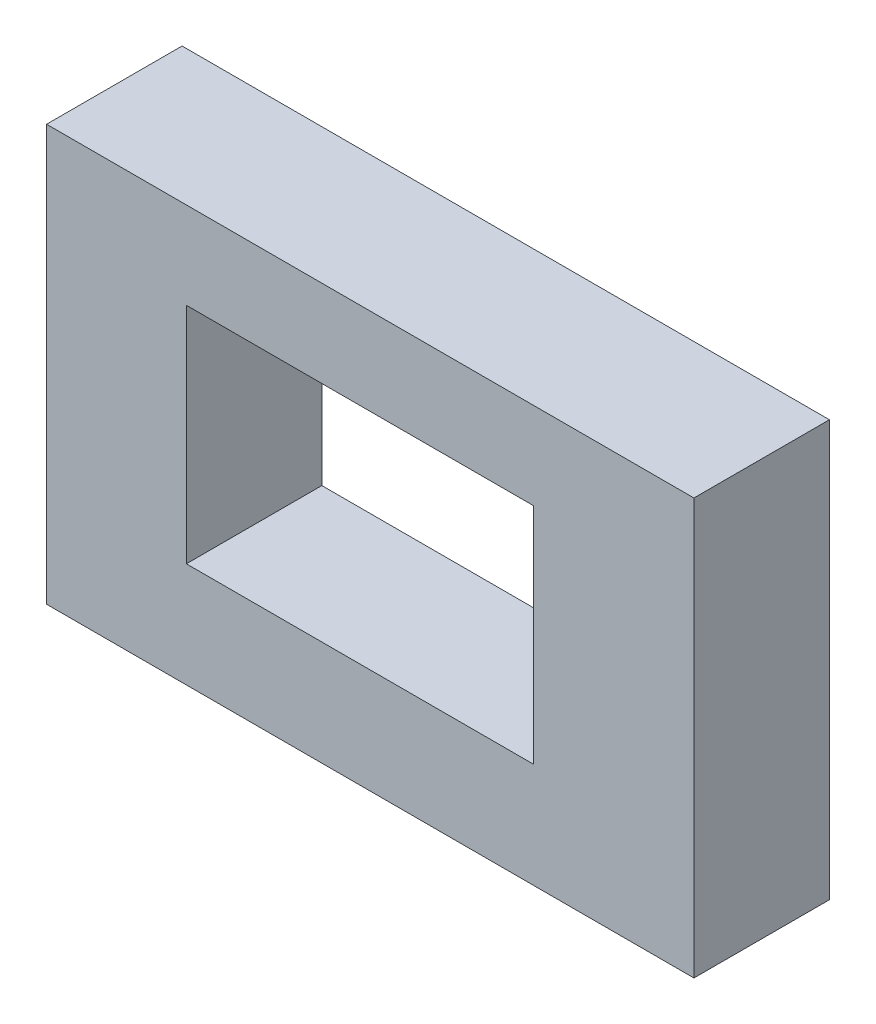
ISO-10303-21;
HEADER;
FILE_DESCRIPTION(('STEP AP214'),'2;1');
FILE_NAME('part.step','',(''),(''),'','','');
FILE_SCHEMA(('AUTOMOTIVE_DESIGN { 1 0 10303 214 1 1 1 1 }'));
ENDSEC;
DATA;
#1=APPLICATION_CONTEXT('core data for automotive mechanical design processes');
#2=APPLICATION_PROTOCOL_DEFINITION('international standard','automotive_design',2000,#1);
#3=PRODUCT_CONTEXT('',#1,'mechanical');
#4=PRODUCT('Part','Part','',(#3));
#5=PRODUCT_RELATED_PRODUCT_CATEGORY('part','',(#4));
#6=PRODUCT_DEFINITION_FORMATION('','',#4);
#7=PRODUCT_DEFINITION_CONTEXT('part definition',#1,'design');
#8=PRODUCT_DEFINITION('design','',#6,#7);
#9=PRODUCT_DEFINITION_SHAPE('','',#8);
#10=(LENGTH_UNIT() NAMED_UNIT(*) SI_UNIT(.MILLI.,.METRE.));
#11=(NAMED_UNIT(*) PLANE_ANGLE_UNIT() SI_UNIT($,.RADIAN.));
#12=(NAMED_UNIT(*) SI_UNIT($,.STERADIAN.) SOLID_ANGLE_UNIT());
#13=UNCERTAINTY_MEASURE_WITH_UNIT(LENGTH_MEASURE(1.E-05),#10,'distance_accuracy_value','');
#14=(GEOMETRIC_REPRESENTATION_CONTEXT(3) GLOBAL_UNCERTAINTY_ASSIGNED_CONTEXT((#13)) GLOBAL_UNIT_ASSIGNED_CONTEXT((#10,
#11,#12)) REPRESENTATION_CONTEXT('',''));
#15=CARTESIAN_POINT('',(0.,0.,0.));
#16=DIRECTION('',(0.,0.,1.));
#17=DIRECTION('',(1.,0.,0.));
#18=AXIS2_PLACEMENT_3D('',#15,#16,#17);
#19=CARTESIAN_POINT('',(0.,0.,10.));
#20=DIRECTION('',(0.,0.,-1.));
#21=DIRECTION('',(-1.,0.,0.));
#22=AXIS2_PLACEMENT_3D('',#19,#20,#21);
#23=PLANE('',#22);
#24=DIRECTION('',(0.,1.,0.));
#25=VECTOR('',#24,1.);
#26=CARTESIAN_POINT('',(23.8891463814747,-16.2183195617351,10.));
#27=LINE('',#26,#25);
#28=CARTESIAN_POINT('',(23.8891463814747,-16.2183195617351,10.));
#29=VERTEX_POINT('',#28);
#30=CARTESIAN_POINT('',(23.8891463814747,14.4649877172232,10.));
#31=VERTEX_POINT('',#30);
#32=EDGE_CURVE('E134',#29,#31,#27,.T.);
#33=ORIENTED_EDGE('',*,*,#32,.T.);
#34=DIRECTION('',(-1.,0.,0.));
#35=VECTOR('',#34,1.);
#36=CARTESIAN_POINT('',(-23.8891463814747,14.4649877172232,10.));
#37=LINE('',#36,#35);
#38=CARTESIAN_POINT('',(-23.8891463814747,14.4649877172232,10.));
#39=VERTEX_POINT('',#38);
#40=EDGE_CURVE('E137',#31,#39,#37,.T.);
#41=ORIENTED_EDGE('',*,*,#40,.T.);
#42=DIRECTION('',(0.,-1.,0.));
#43=VECTOR('',#42,1.);
#44=CARTESIAN_POINT('',(-23.8891463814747,-16.2183195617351,10.));
#45=LINE('',#44,#43);
#46=CARTESIAN_POINT('',(-23.8891463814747,-16.2183195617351,10.));
#47=VERTEX_POINT('',#46);
#48=EDGE_CURVE('E140',#39,#47,#45,.T.);
#49=ORIENTED_EDGE('',*,*,#48,.T.);
#50=DIRECTION('',(1.,0.,0.));
#51=VECTOR('',#50,1.);
#52=CARTESIAN_POINT('',(-23.8891463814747,-16.2183195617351,10.));
#53=LINE('',#52,#51);
#54=EDGE_CURVE('E142',#47,#29,#53,.T.);
#55=ORIENTED_EDGE('',*,*,#54,.T.);
#56=EDGE_LOOP('',(#33,#41,#49,#55));
#57=FACE_BOUND('',#56,.T.);
#58=DIRECTION('',(0.,1.,0.));
#59=VECTOR('',#58,1.);
#60=CARTESIAN_POINT('',(12.064003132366,-8.47367297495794,10.));
#61=LINE('',#60,#59);
#62=CARTESIAN_POINT('',(12.064003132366,-8.47367297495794,10.));
#63=VERTEX_POINT('',#62);
#64=CARTESIAN_POINT('',(12.064003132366,8.05080119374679,10.));
#65=VERTEX_POINT('',#64);
#66=EDGE_CURVE('E98',#63,#65,#61,.T.);
#67=ORIENTED_EDGE('',*,*,#66,.F.);
#68=DIRECTION('',(1.,0.,0.));
#69=VECTOR('',#68,1.);
#70=CARTESIAN_POINT('',(-13.5720035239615,-8.47367297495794,10.));
#71=LINE('',#70,#69);
#72=CARTESIAN_POINT('',(-13.5720035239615,-8.47367297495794,10.));
#73=VERTEX_POINT('',#72);
#74=EDGE_CURVE('E120',#73,#63,#71,.T.);
#75=ORIENTED_EDGE('',*,*,#74,.F.);
#76=DIRECTION('',(0.,-1.,0.));
#77=VECTOR('',#76,1.);
#78=CARTESIAN_POINT('',(-13.5720035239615,-8.47367297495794,10.));
#79=LINE('',#78,#77);
#80=CARTESIAN_POINT('',(-13.5720035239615,8.05080119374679,10.));
#81=VERTEX_POINT('',#80);
#82=EDGE_CURVE('E118',#81,#73,#79,.T.);
#83=ORIENTED_EDGE('',*,*,#82,.F.);
#84=DIRECTION('',(-1.,0.,0.));
#85=VECTOR('',#84,1.);
#86=CARTESIAN_POINT('',(-13.5720035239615,8.05080119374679,10.));
#87=LINE('',#86,#85);
#88=EDGE_CURVE('E106',#65,#81,#87,.T.);
#89=ORIENTED_EDGE('',*,*,#88,.F.);
#90=EDGE_LOOP('',(#67,#75,#83,#89));
#91=FACE_BOUND('',#90,.T.);
#92=ADVANCED_FACE('F33',(#57,#91),#23,.F.);
#93=CARTESIAN_POINT('',(0.,0.,0.));
#94=DIRECTION('',(0.,0.,-1.));
#95=DIRECTION('',(-1.,0.,0.));
#96=AXIS2_PLACEMENT_3D('',#93,#94,#95);
#97=PLANE('',#96);
#98=DIRECTION('',(0.,1.,0.));
#99=VECTOR('',#98,1.);
#100=CARTESIAN_POINT('',(23.8891463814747,-16.2183195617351,0.));
#101=LINE('',#100,#99);
#102=CARTESIAN_POINT('',(23.8891463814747,-16.2183195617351,0.));
#103=VERTEX_POINT('',#102);
#104=CARTESIAN_POINT('',(23.8891463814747,14.4649877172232,0.));
#105=VERTEX_POINT('',#104);
#106=EDGE_CURVE('E114',#103,#105,#101,.T.);
#107=ORIENTED_EDGE('',*,*,#106,.F.);
#108=DIRECTION('',(1.,0.,0.));
#109=VECTOR('',#108,1.);
#110=CARTESIAN_POINT('',(-23.8891463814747,-16.2183195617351,0.));
#111=LINE('',#110,#109);
#112=CARTESIAN_POINT('',(-23.8891463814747,-16.2183195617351,0.));
#113=VERTEX_POINT('',#112);
#114=EDGE_CURVE('E138',#113,#103,#111,.T.);
#115=ORIENTED_EDGE('',*,*,#114,.F.);
#116=DIRECTION('',(0.,-1.,0.));
#117=VECTOR('',#116,1.);
#118=CARTESIAN_POINT('',(-23.8891463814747,-16.2183195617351,0.));
#119=LINE('',#118,#117);
#120=CARTESIAN_POINT('',(-23.8891463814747,14.4649877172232,0.));
#121=VERTEX_POINT('',#120);
#122=EDGE_CURVE('E149',#121,#113,#119,.T.);
#123=ORIENTED_EDGE('',*,*,#122,.F.);
#124=DIRECTION('',(-1.,0.,0.));
#125=VECTOR('',#124,1.);
#126=CARTESIAN_POINT('',(-23.8891463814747,14.4649877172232,0.));
#127=LINE('',#126,#125);
#128=EDGE_CURVE('E147',#105,#121,#127,.T.);
#129=ORIENTED_EDGE('',*,*,#128,.F.);
#130=EDGE_LOOP('',(#107,#115,#123,#129));
#131=FACE_BOUND('',#130,.T.);
#132=DIRECTION('',(1.,0.,0.));
#133=VECTOR('',#132,1.);
#134=CARTESIAN_POINT('',(-13.5720035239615,-8.47367297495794,0.));
#135=LINE('',#134,#133);
#136=CARTESIAN_POINT('',(-13.5720035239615,-8.47367297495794,0.));
#137=VERTEX_POINT('',#136);
#138=CARTESIAN_POINT('',(12.064003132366,-8.47367297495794,0.));
#139=VERTEX_POINT('',#138);
#140=EDGE_CURVE('E107',#137,#139,#135,.T.);
#141=ORIENTED_EDGE('',*,*,#140,.T.);
#142=DIRECTION('',(0.,1.,0.));
#143=VECTOR('',#142,1.);
#144=CARTESIAN_POINT('',(12.064003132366,-8.47367297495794,0.));
#145=LINE('',#144,#143);
#146=CARTESIAN_POINT('',(12.064003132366,8.05080119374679,0.));
#147=VERTEX_POINT('',#146);
#148=EDGE_CURVE('E56',#139,#147,#145,.T.);
#149=ORIENTED_EDGE('',*,*,#148,.T.);
#150=DIRECTION('',(-1.,0.,0.));
#151=VECTOR('',#150,1.);
#152=CARTESIAN_POINT('',(-13.5720035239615,8.05080119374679,0.));
#153=LINE('',#152,#151);
#154=CARTESIAN_POINT('',(-13.5720035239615,8.05080119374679,0.));
#155=VERTEX_POINT('',#154);
#156=EDGE_CURVE('E113',#147,#155,#153,.T.);
#157=ORIENTED_EDGE('',*,*,#156,.T.);
#158=DIRECTION('',(0.,-1.,0.));
#159=VECTOR('',#158,1.);
#160=CARTESIAN_POINT('',(-13.5720035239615,-8.47367297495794,0.));
#161=LINE('',#160,#159);
#162=EDGE_CURVE('E126',#155,#137,#161,.T.);
#163=ORIENTED_EDGE('',*,*,#162,.T.);
#164=EDGE_LOOP('',(#141,#149,#157,#163));
#165=FACE_BOUND('',#164,.T.);
#166=ADVANCED_FACE('F167',(#131,#165),#97,.T.);
#167=CARTESIAN_POINT('',(23.8891463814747,-16.2183195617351,10.));
#168=DIRECTION('',(-1.,0.,0.));
#169=DIRECTION('',(0.,0.,1.));
#170=AXIS2_PLACEMENT_3D('',#167,#168,#169);
#171=PLANE('',#170);
#172=ORIENTED_EDGE('',*,*,#106,.T.);
#173=DIRECTION('',(0.,0.,-1.));
#174=VECTOR('',#173,1.);
#175=CARTESIAN_POINT('',(23.8891463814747,14.4649877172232,10.));
#176=LINE('',#175,#174);
#177=EDGE_CURVE('E11',#31,#105,#176,.T.);
#178=ORIENTED_EDGE('',*,*,#177,.F.);
#179=ORIENTED_EDGE('',*,*,#32,.F.);
#180=DIRECTION('',(0.,0.,-1.));
#181=VECTOR('',#180,1.);
#182=CARTESIAN_POINT('',(23.8891463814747,-16.2183195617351,10.));
#183=LINE('',#182,#181);
#184=EDGE_CURVE('E144',#29,#103,#183,.T.);
#185=ORIENTED_EDGE('',*,*,#184,.T.);
#186=EDGE_LOOP('',(#172,#178,#179,#185));
#187=FACE_BOUND('',#186,.T.);
#188=ADVANCED_FACE('F35',(#187),#171,.F.);
#189=CARTESIAN_POINT('',(-23.8891463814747,14.4649877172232,10.));
#190=DIRECTION('',(0.,-1.,0.));
#191=DIRECTION('',(0.,0.,-1.));
#192=AXIS2_PLACEMENT_3D('',#189,#190,#191);
#193=PLANE('',#192);
#194=ORIENTED_EDGE('',*,*,#128,.T.);
#195=DIRECTION('',(0.,0.,-1.));
#196=VECTOR('',#195,1.);
#197=CARTESIAN_POINT('',(-23.8891463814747,14.4649877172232,10.));
#198=LINE('',#197,#196);
#199=EDGE_CURVE('E41',#39,#121,#198,.T.);
#200=ORIENTED_EDGE('',*,*,#199,.F.);
#201=ORIENTED_EDGE('',*,*,#40,.F.);
#202=ORIENTED_EDGE('',*,*,#177,.T.);
#203=EDGE_LOOP('',(#194,#200,#201,#202));
#204=FACE_BOUND('',#203,.T.);
#205=ADVANCED_FACE('F177',(#204),#193,.F.);
#206=CARTESIAN_POINT('',(-23.8891463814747,-16.2183195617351,10.));
#207=DIRECTION('',(1.,0.,0.));
#208=DIRECTION('',(0.,0.,-1.));
#209=AXIS2_PLACEMENT_3D('',#206,#207,#208);
#210=PLANE('',#209);
#211=ORIENTED_EDGE('',*,*,#122,.T.);
#212=DIRECTION('',(0.,0.,-1.));
#213=VECTOR('',#212,1.);
#214=CARTESIAN_POINT('',(-23.8891463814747,-16.2183195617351,10.));
#215=LINE('',#214,#213);
#216=EDGE_CURVE('E154',#47,#113,#215,.T.);
#217=ORIENTED_EDGE('',*,*,#216,.F.);
#218=ORIENTED_EDGE('',*,*,#48,.F.);
#219=ORIENTED_EDGE('',*,*,#199,.T.);
#220=EDGE_LOOP('',(#211,#217,#218,#219));
#221=FACE_BOUND('',#220,.T.);
#222=ADVANCED_FACE('F161',(#221),#210,.F.);
#223=CARTESIAN_POINT('',(-23.8891463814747,-16.2183195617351,10.));
#224=DIRECTION('',(0.,1.,0.));
#225=DIRECTION('',(0.,0.,1.));
#226=AXIS2_PLACEMENT_3D('',#223,#224,#225);
#227=PLANE('',#226);
#228=ORIENTED_EDGE('',*,*,#114,.T.);
#229=ORIENTED_EDGE('',*,*,#184,.F.);
#230=ORIENTED_EDGE('',*,*,#54,.F.);
#231=ORIENTED_EDGE('',*,*,#216,.T.);
#232=EDGE_LOOP('',(#228,#229,#230,#231));
#233=FACE_BOUND('',#232,.T.);
#234=ADVANCED_FACE('F171',(#233),#227,.F.);
#235=CARTESIAN_POINT('',(12.064003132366,-8.47367297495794,10.));
#236=DIRECTION('',(-1.,0.,0.));
#237=DIRECTION('',(0.,0.,1.));
#238=AXIS2_PLACEMENT_3D('',#235,#236,#237);
#239=PLANE('',#238);
#240=ORIENTED_EDGE('',*,*,#148,.F.);
#241=DIRECTION('',(0.,0.,-1.));
#242=VECTOR('',#241,1.);
#243=CARTESIAN_POINT('',(12.064003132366,-8.47367297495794,10.));
#244=LINE('',#243,#242);
#245=EDGE_CURVE('E102',#63,#139,#244,.T.);
#246=ORIENTED_EDGE('',*,*,#245,.F.);
#247=ORIENTED_EDGE('',*,*,#66,.T.);
#248=DIRECTION('',(0.,0.,-1.));
#249=VECTOR('',#248,1.);
#250=CARTESIAN_POINT('',(12.064003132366,8.05080119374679,10.));
#251=LINE('',#250,#249);
#252=EDGE_CURVE('E101',#65,#147,#251,.T.);
#253=ORIENTED_EDGE('',*,*,#252,.T.);
#254=EDGE_LOOP('',(#240,#246,#247,#253));
#255=FACE_BOUND('',#254,.T.);
#256=ADVANCED_FACE('F100',(#255),#239,.T.);
#257=CARTESIAN_POINT('',(-13.5720035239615,8.05080119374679,10.));
#258=DIRECTION('',(0.,-1.,0.));
#259=DIRECTION('',(0.,0.,-1.));
#260=AXIS2_PLACEMENT_3D('',#257,#258,#259);
#261=PLANE('',#260);
#262=ORIENTED_EDGE('',*,*,#156,.F.);
#263=ORIENTED_EDGE('',*,*,#252,.F.);
#264=ORIENTED_EDGE('',*,*,#88,.T.);
#265=DIRECTION('',(0.,0.,-1.));
#266=VECTOR('',#265,1.);
#267=CARTESIAN_POINT('',(-13.5720035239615,8.05080119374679,10.));
#268=LINE('',#267,#266);
#269=EDGE_CURVE('E115',#81,#155,#268,.T.);
#270=ORIENTED_EDGE('',*,*,#269,.T.);
#271=EDGE_LOOP('',(#262,#263,#264,#270));
#272=FACE_BOUND('',#271,.T.);
#273=ADVANCED_FACE('F110',(#272),#261,.T.);
#274=CARTESIAN_POINT('',(-13.5720035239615,-8.47367297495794,10.));
#275=DIRECTION('',(1.,0.,0.));
#276=DIRECTION('',(0.,0.,-1.));
#277=AXIS2_PLACEMENT_3D('',#274,#275,#276);
#278=PLANE('',#277);
#279=ORIENTED_EDGE('',*,*,#162,.F.);
#280=ORIENTED_EDGE('',*,*,#269,.F.);
#281=ORIENTED_EDGE('',*,*,#82,.T.);
#282=DIRECTION('',(0.,0.,-1.));
#283=VECTOR('',#282,1.);
#284=CARTESIAN_POINT('',(-13.5720035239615,-8.47367297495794,10.));
#285=LINE('',#284,#283);
#286=EDGE_CURVE('E48',#73,#137,#285,.T.);
#287=ORIENTED_EDGE('',*,*,#286,.T.);
#288=EDGE_LOOP('',(#279,#280,#281,#287));
#289=FACE_BOUND('',#288,.T.);
#290=ADVANCED_FACE('F200',(#289),#278,.T.);
#291=CARTESIAN_POINT('',(-13.5720035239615,-8.47367297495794,10.));
#292=DIRECTION('',(0.,1.,0.));
#293=DIRECTION('',(0.,0.,1.));
#294=AXIS2_PLACEMENT_3D('',#291,#292,#293);
#295=PLANE('',#294);
#296=ORIENTED_EDGE('',*,*,#140,.F.);
#297=ORIENTED_EDGE('',*,*,#286,.F.);
#298=ORIENTED_EDGE('',*,*,#74,.T.);
#299=ORIENTED_EDGE('',*,*,#245,.T.);
#300=EDGE_LOOP('',(#296,#297,#298,#299));
#301=FACE_BOUND('',#300,.T.);
#302=ADVANCED_FACE('F204',(#301),#295,.T.);
#303=CLOSED_SHELL('',(#92,#166,#188,#205,#222,#234,#256,#273,#290,#302));
#304=MANIFOLD_SOLID_BREP('B2',#303);
#305=ADVANCED_BREP_SHAPE_REPRESENTATION('',(#18,#304),#14);
#306=SHAPE_DEFINITION_REPRESENTATION(#9,#305);
ENDSEC;
END-ISO-10303-21;
